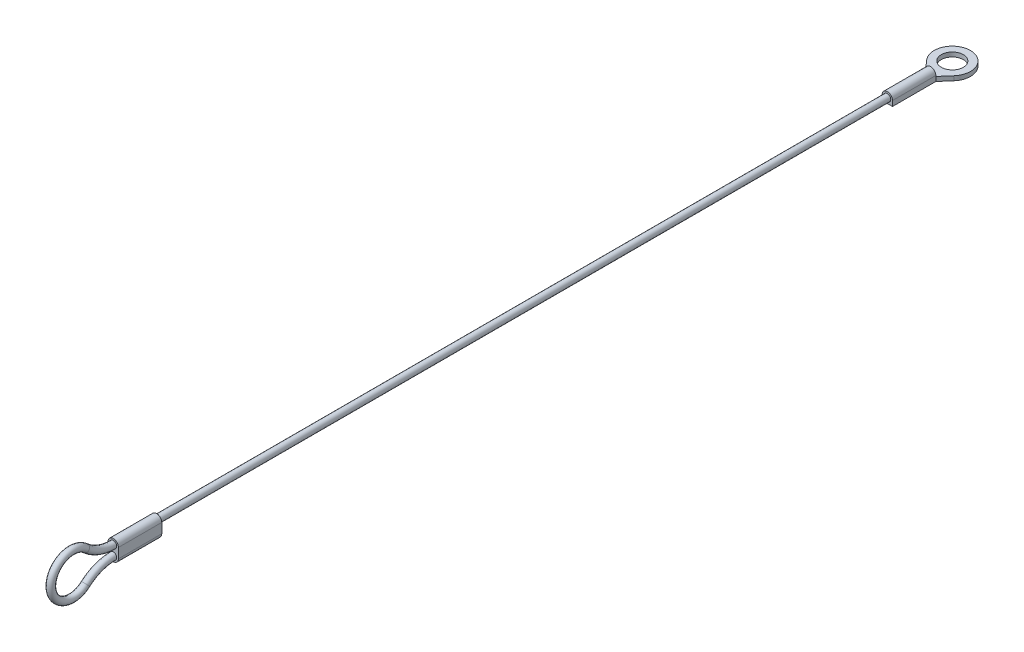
from build123d import *

# Parameters (mm, degrees)
SKETCH2_R           = 0.795
BOSS_EXTRUDE1_DEPTH = 10
BOSS_EXTRUDE2_DEPTH = 10
SKETCH5_R           = 2.54
BOSS_EXTRUDE3_DEPTH = 1.01


with BuildPart() as part:
    # Sweep1: sweep along a path in Sketch1
    with BuildLine(Plane(origin=(0, 0, 0), x_dir=(0, 0, -1), z_dir=(1, 0, 0))) as sweep1_path:
        Line((0, 0), (-178.6, 0))
        ThreePointArc((-178.6, 0), (-182.025492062, 0.631945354), (-185, 2.444582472))
        ThreePointArc((-185, 2.444582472), (-193, -1.133126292), (-185, -4.710835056))
        ThreePointArc((-185, -4.710835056), (-182.025492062, -2.898197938), (-178.6, -2.266252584))
    # Sketch2 → Sweep1 (sweep)
    with BuildSketch(Plane.XY):
        Circle(SKETCH2_R)
    sweep(path=sweep1_path.line)

    # Sketch3 → Boss-Extrude1 (add)
    with BuildSketch(Plane(origin=(0, 0, 178.6), x_dir=(-1, 0, 0), z_dir=(0, 0, -1))):
        with BuildLine():
            Line((1.195, 0), (1.195, -2.266252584))
            ThreePointArc((1.195, -2.266252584), (0, -3.461252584), (-1.195, -2.266252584))
            Line((-1.195, -2.266252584), (-1.195, 0))
            ThreePointArc((-1.195, 0), (0, 1.195), (1.195, 0))
        make_face()
    extrude(amount=BOSS_EXTRUDE1_DEPTH)

    # Sketch4 → Boss-Extrude2 (add)
    with BuildSketch(Plane(origin=(0, 0, 0), x_dir=(-1, 0, 0), z_dir=(0, 0, -1))):
        with BuildLine():
            Line((-1.195, 0), (-1.195, -1.195))
            Line((-1.195, -1.195), (0, -1.195))
            Line((0, -1.195), (1.195, -1.195))
            Line((1.195, -1.195), (1.195, 0))
            ThreePointArc((1.195, 0), (0, 1.195), (-1.195, 0))
        make_face()
    extrude(amount=BOSS_EXTRUDE2_DEPTH)

    # Sketch5 → Boss-Extrude3 (add)
    with BuildSketch(Plane.XZ.offset(1.195)):
        with BuildLine():
            Line((-1.195, -10), (1.195, -10))
            Line((1.195, -10), (3.155012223, -12.242827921))
            ThreePointArc((3.155012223, -12.242827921), (0, -19.19), (-3.155012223, -12.242827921))
            Line((-3.155012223, -12.242827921), (-1.195, -10))
        make_face()
        with Locations(Location((0, -15, 0), (0, 0, 270))):
            Circle(SKETCH5_R, mode=Mode.SUBTRACT)
    extrude(amount=-BOSS_EXTRUDE3_DEPTH)


solid = part.part
